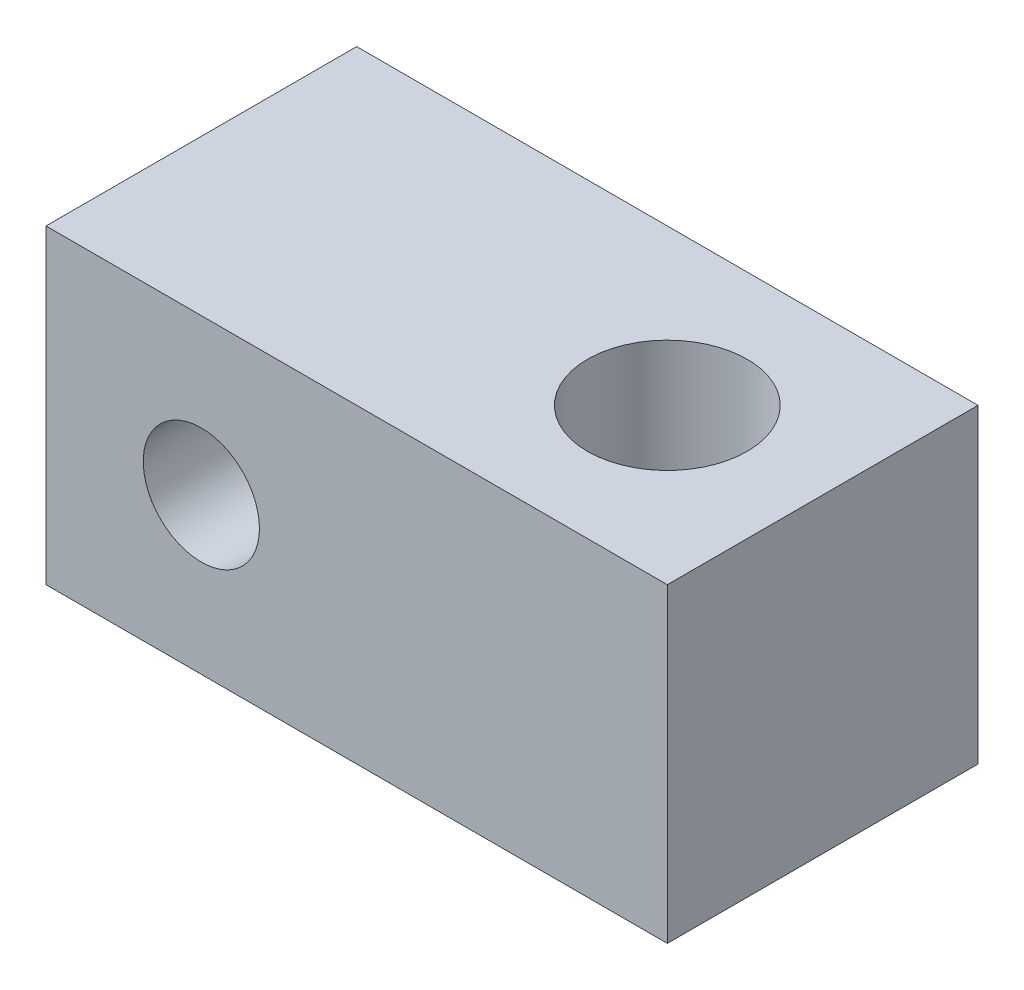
ISO-10303-21;
HEADER;
FILE_DESCRIPTION(('STEP AP214'),'2;1');
FILE_NAME('part.step','',(''),(''),'','','');
FILE_SCHEMA(('AUTOMOTIVE_DESIGN { 1 0 10303 214 1 1 1 1 }'));
ENDSEC;
DATA;
#1=APPLICATION_CONTEXT('core data for automotive mechanical design processes');
#2=APPLICATION_PROTOCOL_DEFINITION('international standard','automotive_design',2000,#1);
#3=PRODUCT_CONTEXT('',#1,'mechanical');
#4=PRODUCT('Part','Part','',(#3));
#5=PRODUCT_RELATED_PRODUCT_CATEGORY('part','',(#4));
#6=PRODUCT_DEFINITION_FORMATION('','',#4);
#7=PRODUCT_DEFINITION_CONTEXT('part definition',#1,'design');
#8=PRODUCT_DEFINITION('design','',#6,#7);
#9=PRODUCT_DEFINITION_SHAPE('','',#8);
#10=(LENGTH_UNIT() NAMED_UNIT(*) SI_UNIT(.MILLI.,.METRE.));
#11=(NAMED_UNIT(*) PLANE_ANGLE_UNIT() SI_UNIT($,.RADIAN.));
#12=(NAMED_UNIT(*) SI_UNIT($,.STERADIAN.) SOLID_ANGLE_UNIT());
#13=UNCERTAINTY_MEASURE_WITH_UNIT(LENGTH_MEASURE(1.E-05),#10,'distance_accuracy_value','');
#14=(GEOMETRIC_REPRESENTATION_CONTEXT(3) GLOBAL_UNCERTAINTY_ASSIGNED_CONTEXT((#13)) GLOBAL_UNIT_ASSIGNED_CONTEXT((#10,
#11,#12)) REPRESENTATION_CONTEXT('',''));
#15=CARTESIAN_POINT('',(0.,0.,0.));
#16=DIRECTION('',(0.,0.,1.));
#17=DIRECTION('',(1.,0.,0.));
#18=AXIS2_PLACEMENT_3D('',#15,#16,#17);
#19=CARTESIAN_POINT('',(0.,0.,6.35));
#20=DIRECTION('',(1.,0.,0.));
#21=DIRECTION('',(0.,1.,0.));
#22=AXIS2_PLACEMENT_3D('',#19,#20,#21);
#23=PLANE('',#22);
#24=DIRECTION('',(0.,-1.,0.));
#25=VECTOR('',#24,1.);
#26=CARTESIAN_POINT('',(0.,0.,0.));
#27=LINE('',#26,#25);
#28=CARTESIAN_POINT('',(0.,0.,0.));
#29=VERTEX_POINT('',#28);
#30=CARTESIAN_POINT('',(0.,-6.35,0.));
#31=VERTEX_POINT('',#30);
#32=EDGE_CURVE('E94',#29,#31,#27,.T.);
#33=ORIENTED_EDGE('',*,*,#32,.T.);
#34=DIRECTION('',(0.,0.,-1.));
#35=VECTOR('',#34,1.);
#36=CARTESIAN_POINT('',(0.,-6.35,6.35));
#37=LINE('',#36,#35);
#38=CARTESIAN_POINT('',(0.,-6.35,6.35));
#39=VERTEX_POINT('',#38);
#40=EDGE_CURVE('E11',#39,#31,#37,.T.);
#41=ORIENTED_EDGE('',*,*,#40,.F.);
#42=DIRECTION('',(0.,-1.,0.));
#43=VECTOR('',#42,1.);
#44=CARTESIAN_POINT('',(0.,0.,6.35));
#45=LINE('',#44,#43);
#46=CARTESIAN_POINT('',(0.,0.,6.35));
#47=VERTEX_POINT('',#46);
#48=EDGE_CURVE('E82',#47,#39,#45,.T.);
#49=ORIENTED_EDGE('',*,*,#48,.F.);
#50=DIRECTION('',(0.,0.,-1.));
#51=VECTOR('',#50,1.);
#52=CARTESIAN_POINT('',(0.,0.,6.35));
#53=LINE('',#52,#51);
#54=EDGE_CURVE('E90',#47,#29,#53,.T.);
#55=ORIENTED_EDGE('',*,*,#54,.T.);
#56=EDGE_LOOP('',(#33,#41,#49,#55));
#57=FACE_BOUND('',#56,.T.);
#58=ADVANCED_FACE('F31',(#57),#23,.F.);
#59=CARTESIAN_POINT('',(0.,-6.35,6.35));
#60=DIRECTION('',(0.,1.,0.));
#61=DIRECTION('',(0.,0.,1.));
#62=AXIS2_PLACEMENT_3D('',#59,#60,#61);
#63=PLANE('',#62);
#64=CARTESIAN_POINT('',(9.525,-6.35,3.175));
#65=DIRECTION('',(0.,1.,0.));
#66=DIRECTION('',(0.,0.,1.));
#67=AXIS2_PLACEMENT_3D('',#64,#65,#66);
#68=CIRCLE('',#67,1.63195);
#69=CARTESIAN_POINT('',(9.525,-6.35,4.80695));
#70=VERTEX_POINT('',#69);
#71=EDGE_CURVE('E113',#70,#70,#68,.T.);
#72=ORIENTED_EDGE('',*,*,#71,.T.);
#73=EDGE_LOOP('',(#72));
#74=FACE_BOUND('',#73,.T.);
#75=DIRECTION('',(1.,0.,0.));
#76=VECTOR('',#75,1.);
#77=CARTESIAN_POINT('',(0.,-6.35,0.));
#78=LINE('',#77,#76);
#79=CARTESIAN_POINT('',(12.7,-6.35,0.));
#80=VERTEX_POINT('',#79);
#81=EDGE_CURVE('E86',#31,#80,#78,.T.);
#82=ORIENTED_EDGE('',*,*,#81,.T.);
#83=DIRECTION('',(0.,0.,-1.));
#84=VECTOR('',#83,1.);
#85=CARTESIAN_POINT('',(12.7,-6.35,6.35));
#86=LINE('',#85,#84);
#87=CARTESIAN_POINT('',(12.7,-6.35,6.35));
#88=VERTEX_POINT('',#87);
#89=EDGE_CURVE('E39',#88,#80,#86,.T.);
#90=ORIENTED_EDGE('',*,*,#89,.F.);
#91=DIRECTION('',(1.,0.,0.));
#92=VECTOR('',#91,1.);
#93=CARTESIAN_POINT('',(0.,-6.35,6.35));
#94=LINE('',#93,#92);
#95=EDGE_CURVE('E77',#39,#88,#94,.T.);
#96=ORIENTED_EDGE('',*,*,#95,.F.);
#97=ORIENTED_EDGE('',*,*,#40,.T.);
#98=EDGE_LOOP('',(#82,#90,#96,#97));
#99=FACE_BOUND('',#98,.T.);
#100=ADVANCED_FACE('F85',(#74,#99),#63,.F.);
#101=CARTESIAN_POINT('',(12.7,0.,6.35));
#102=DIRECTION('',(-1.,0.,0.));
#103=DIRECTION('',(0.,-1.,0.));
#104=AXIS2_PLACEMENT_3D('',#101,#102,#103);
#105=PLANE('',#104);
#106=DIRECTION('',(0.,1.,0.));
#107=VECTOR('',#106,1.);
#108=CARTESIAN_POINT('',(12.7,0.,0.));
#109=LINE('',#108,#107);
#110=CARTESIAN_POINT('',(12.7,0.,0.));
#111=VERTEX_POINT('',#110);
#112=EDGE_CURVE('E64',#80,#111,#109,.T.);
#113=ORIENTED_EDGE('',*,*,#112,.T.);
#114=DIRECTION('',(0.,0.,-1.));
#115=VECTOR('',#114,1.);
#116=CARTESIAN_POINT('',(12.7,0.,6.35));
#117=LINE('',#116,#115);
#118=CARTESIAN_POINT('',(12.7,0.,6.35));
#119=VERTEX_POINT('',#118);
#120=EDGE_CURVE('E87',#119,#111,#117,.T.);
#121=ORIENTED_EDGE('',*,*,#120,.F.);
#122=DIRECTION('',(0.,1.,0.));
#123=VECTOR('',#122,1.);
#124=CARTESIAN_POINT('',(12.7,0.,6.35));
#125=LINE('',#124,#123);
#126=EDGE_CURVE('E80',#88,#119,#125,.T.);
#127=ORIENTED_EDGE('',*,*,#126,.F.);
#128=ORIENTED_EDGE('',*,*,#89,.T.);
#129=EDGE_LOOP('',(#113,#121,#127,#128));
#130=FACE_BOUND('',#129,.T.);
#131=ADVANCED_FACE('F88',(#130),#105,.F.);
#132=CARTESIAN_POINT('',(0.,0.,6.35));
#133=DIRECTION('',(0.,-1.,0.));
#134=DIRECTION('',(0.,0.,-1.));
#135=AXIS2_PLACEMENT_3D('',#132,#133,#134);
#136=PLANE('',#135);
#137=CARTESIAN_POINT('',(9.525,0.,3.175));
#138=DIRECTION('',(0.,1.,0.));
#139=DIRECTION('',(0.,0.,1.));
#140=AXIS2_PLACEMENT_3D('',#137,#138,#139);
#141=CIRCLE('',#140,1.63194999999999);
#142=CARTESIAN_POINT('',(9.525,0.,4.80694999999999));
#143=VERTEX_POINT('',#142);
#144=EDGE_CURVE('E116',#143,#143,#141,.T.);
#145=ORIENTED_EDGE('',*,*,#144,.F.);
#146=EDGE_LOOP('',(#145));
#147=FACE_BOUND('',#146,.T.);
#148=DIRECTION('',(-1.,0.,0.));
#149=VECTOR('',#148,1.);
#150=CARTESIAN_POINT('',(0.,0.,0.));
#151=LINE('',#150,#149);
#152=EDGE_CURVE('E70',#111,#29,#151,.T.);
#153=ORIENTED_EDGE('',*,*,#152,.T.);
#154=ORIENTED_EDGE('',*,*,#54,.F.);
#155=DIRECTION('',(-1.,0.,0.));
#156=VECTOR('',#155,1.);
#157=CARTESIAN_POINT('',(0.,0.,6.35));
#158=LINE('',#157,#156);
#159=EDGE_CURVE('E47',#119,#47,#158,.T.);
#160=ORIENTED_EDGE('',*,*,#159,.F.);
#161=ORIENTED_EDGE('',*,*,#120,.T.);
#162=EDGE_LOOP('',(#153,#154,#160,#161));
#163=FACE_BOUND('',#162,.T.);
#164=ADVANCED_FACE('F102',(#147,#163),#136,.F.);
#165=CARTESIAN_POINT('',(0.,-6.35,6.35));
#166=DIRECTION('',(0.,0.,1.));
#167=DIRECTION('',(1.,0.,0.));
#168=AXIS2_PLACEMENT_3D('',#165,#166,#167);
#169=PLANE('',#168);
#170=CARTESIAN_POINT('',(3.175,-3.175,6.35));
#171=DIRECTION('',(0.,0.,1.));
#172=DIRECTION('',(1.,0.,0.));
#173=AXIS2_PLACEMENT_3D('',#170,#171,#172);
#174=CIRCLE('',#173,1.18745);
#175=CARTESIAN_POINT('',(4.36245,-3.175,6.35));
#176=VERTEX_POINT('',#175);
#177=EDGE_CURVE('E110',#176,#176,#174,.T.);
#178=ORIENTED_EDGE('',*,*,#177,.F.);
#179=EDGE_LOOP('',(#178));
#180=FACE_BOUND('',#179,.T.);
#181=ORIENTED_EDGE('',*,*,#48,.T.);
#182=ORIENTED_EDGE('',*,*,#95,.T.);
#183=ORIENTED_EDGE('',*,*,#126,.T.);
#184=ORIENTED_EDGE('',*,*,#159,.T.);
#185=EDGE_LOOP('',(#181,#182,#183,#184));
#186=FACE_BOUND('',#185,.T.);
#187=ADVANCED_FACE('F78',(#180,#186),#169,.T.);
#188=CARTESIAN_POINT('',(0.,-6.35,0.));
#189=DIRECTION('',(0.,0.,1.));
#190=DIRECTION('',(1.,0.,0.));
#191=AXIS2_PLACEMENT_3D('',#188,#189,#190);
#192=PLANE('',#191);
#193=CARTESIAN_POINT('',(3.175,-3.175,0.));
#194=DIRECTION('',(0.,0.,1.));
#195=DIRECTION('',(1.,0.,0.));
#196=AXIS2_PLACEMENT_3D('',#193,#194,#195);
#197=CIRCLE('',#196,1.18745);
#198=CARTESIAN_POINT('',(4.36245,-3.175,0.));
#199=VERTEX_POINT('',#198);
#200=EDGE_CURVE('E97',#199,#199,#197,.T.);
#201=ORIENTED_EDGE('',*,*,#200,.T.);
#202=EDGE_LOOP('',(#201));
#203=FACE_BOUND('',#202,.T.);
#204=ORIENTED_EDGE('',*,*,#32,.F.);
#205=ORIENTED_EDGE('',*,*,#152,.F.);
#206=ORIENTED_EDGE('',*,*,#112,.F.);
#207=ORIENTED_EDGE('',*,*,#81,.F.);
#208=EDGE_LOOP('',(#204,#205,#206,#207));
#209=FACE_BOUND('',#208,.T.);
#210=ADVANCED_FACE('F105',(#203,#209),#192,.F.);
#211=CARTESIAN_POINT('',(3.175,-3.175,6.35));
#212=DIRECTION('',(0.,0.,1.));
#213=DIRECTION('',(1.,0.,0.));
#214=AXIS2_PLACEMENT_3D('',#211,#212,#213);
#215=CYLINDRICAL_SURFACE('',#214,1.18745);
#216=ORIENTED_EDGE('',*,*,#200,.F.);
#217=EDGE_LOOP('',(#216));
#218=FACE_BOUND('',#217,.T.);
#219=ORIENTED_EDGE('',*,*,#177,.T.);
#220=EDGE_LOOP('',(#219));
#221=FACE_BOUND('',#220,.T.);
#222=ADVANCED_FACE('F142',(#218,#221),#215,.F.);
#223=CARTESIAN_POINT('',(9.525,0.,3.175));
#224=DIRECTION('',(0.,1.,0.));
#225=DIRECTION('',(0.,0.,1.));
#226=AXIS2_PLACEMENT_3D('',#223,#224,#225);
#227=CYLINDRICAL_SURFACE('',#226,1.63194999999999);
#228=ORIENTED_EDGE('',*,*,#71,.F.);
#229=EDGE_LOOP('',(#228));
#230=FACE_BOUND('',#229,.T.);
#231=ORIENTED_EDGE('',*,*,#144,.T.);
#232=EDGE_LOOP('',(#231));
#233=FACE_BOUND('',#232,.T.);
#234=ADVANCED_FACE('F120',(#230,#233),#227,.F.);
#235=CLOSED_SHELL('',(#58,#100,#131,#164,#187,#210,#222,#234));
#236=MANIFOLD_SOLID_BREP('B2',#235);
#237=ADVANCED_BREP_SHAPE_REPRESENTATION('',(#18,#236),#14);
#238=SHAPE_DEFINITION_REPRESENTATION(#9,#237);
ENDSEC;
END-ISO-10303-21;
